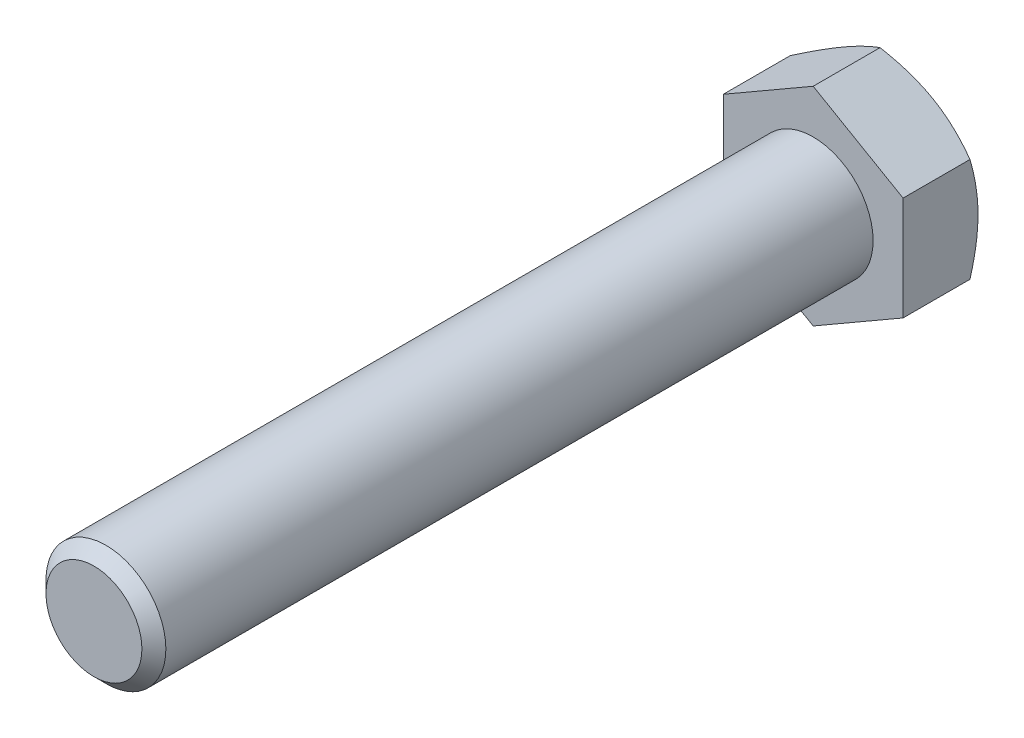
ISO-10303-21;
HEADER;
FILE_DESCRIPTION(('STEP AP214'),'2;1');
FILE_NAME('part.step','',(''),(''),'','','');
FILE_SCHEMA(('AUTOMOTIVE_DESIGN { 1 0 10303 214 1 1 1 1 }'));
ENDSEC;
DATA;
#1=APPLICATION_CONTEXT('core data for automotive mechanical design processes');
#2=APPLICATION_PROTOCOL_DEFINITION('international standard','automotive_design',2000,#1);
#3=PRODUCT_CONTEXT('',#1,'mechanical');
#4=PRODUCT('Part','Part','',(#3));
#5=PRODUCT_RELATED_PRODUCT_CATEGORY('part','',(#4));
#6=PRODUCT_DEFINITION_FORMATION('','',#4);
#7=PRODUCT_DEFINITION_CONTEXT('part definition',#1,'design');
#8=PRODUCT_DEFINITION('design','',#6,#7);
#9=PRODUCT_DEFINITION_SHAPE('','',#8);
#10=(LENGTH_UNIT() NAMED_UNIT(*) SI_UNIT(.MILLI.,.METRE.));
#11=(NAMED_UNIT(*) PLANE_ANGLE_UNIT() SI_UNIT($,.RADIAN.));
#12=(NAMED_UNIT(*) SI_UNIT($,.STERADIAN.) SOLID_ANGLE_UNIT());
#13=UNCERTAINTY_MEASURE_WITH_UNIT(LENGTH_MEASURE(1.E-05),#10,'distance_accuracy_value','');
#14=(GEOMETRIC_REPRESENTATION_CONTEXT(3) GLOBAL_UNCERTAINTY_ASSIGNED_CONTEXT((#13)) GLOBAL_UNIT_ASSIGNED_CONTEXT((#10,
#11,#12)) REPRESENTATION_CONTEXT('',''));
#15=CARTESIAN_POINT('',(0.,0.,0.));
#16=DIRECTION('',(0.,0.,1.));
#17=DIRECTION('',(1.,0.,0.));
#18=AXIS2_PLACEMENT_3D('',#15,#16,#17);
#19=CARTESIAN_POINT('',(0.,0.,120.));
#20=DIRECTION('',(0.,0.,0.999999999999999));
#21=DIRECTION('',(1.,0.,0.));
#22=AXIS2_PLACEMENT_3D('',#19,#20,#21);
#23=PLANE('',#22);
#24=CARTESIAN_POINT('',(0.,0.,120.));
#25=DIRECTION('',(0.,0.,0.999999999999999));
#26=DIRECTION('',(1.,0.,0.));
#27=AXIS2_PLACEMENT_3D('',#24,#25,#26);
#28=CIRCLE('',#27,8.00000000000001);
#29=CARTESIAN_POINT('',(8.00000000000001,0.,120.));
#30=VERTEX_POINT('',#29);
#31=EDGE_CURVE('E204',#30,#30,#28,.T.);
#32=ORIENTED_EDGE('',*,*,#31,.T.);
#33=EDGE_LOOP('',(#32));
#34=FACE_BOUND('',#33,.T.);
#35=ADVANCED_FACE('F30',(#34),#23,.T.);
#36=CARTESIAN_POINT('',(0.,0.,0.));
#37=DIRECTION('',(0.,0.,0.999999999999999));
#38=DIRECTION('',(1.,0.,0.));
#39=AXIS2_PLACEMENT_3D('',#36,#37,#38);
#40=CYLINDRICAL_SURFACE('',#39,10.);
#41=CARTESIAN_POINT('',(0.,-1.38777878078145E-13,118.));
#42=DIRECTION('',(0.,0.,0.999999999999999));
#43=DIRECTION('',(1.,0.,0.));
#44=AXIS2_PLACEMENT_3D('',#41,#42,#43);
#45=CIRCLE('',#44,10.);
#46=CARTESIAN_POINT('',(10.0000000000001,0.,118.));
#47=VERTEX_POINT('',#46);
#48=EDGE_CURVE('E206',#47,#47,#45,.F.);
#49=CARTESIAN_POINT('',(0.,0.,0.));
#50=DIRECTION('',(0.,0.,0.999999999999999));
#51=DIRECTION('',(1.,0.,0.));
#52=AXIS2_PLACEMENT_3D('',#49,#50,#51);
#53=CIRCLE('',#52,10.);
#54=CARTESIAN_POINT('',(10.,0.,0.));
#55=VERTEX_POINT('',#54);
#56=EDGE_CURVE('E207',#55,#55,#53,.F.);
#57=CARTESIAN_POINT('',(10.0000000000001,0.,118.));
#58=CARTESIAN_POINT('',(10.0000000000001,0.,116.770833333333));
#59=CARTESIAN_POINT('',(10.0000000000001,0.,115.541666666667));
#60=CARTESIAN_POINT('',(10.0000000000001,0.,113.083333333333));
#61=CARTESIAN_POINT('',(10.0000000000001,0.,111.854166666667));
#62=CARTESIAN_POINT('',(10.0000000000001,0.,109.395833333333));
#63=CARTESIAN_POINT('',(10.0000000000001,0.,108.166666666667));
#64=CARTESIAN_POINT('',(10.0000000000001,0.,105.708333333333));
#65=CARTESIAN_POINT('',(10.0000000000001,0.,104.479166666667));
#66=CARTESIAN_POINT('',(10.0000000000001,0.,102.020833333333));
#67=CARTESIAN_POINT('',(10.0000000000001,0.,100.791666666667));
#68=CARTESIAN_POINT('',(10.0000000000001,0.,98.3333333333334));
#69=CARTESIAN_POINT('',(10.0000000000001,0.,97.1041666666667));
#70=CARTESIAN_POINT('',(10.0000000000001,0.,94.6458333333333));
#71=CARTESIAN_POINT('',(10.0000000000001,0.,93.4166666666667));
#72=CARTESIAN_POINT('',(10.0000000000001,0.,90.9583333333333));
#73=CARTESIAN_POINT('',(10.0000000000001,0.,89.7291666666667));
#74=CARTESIAN_POINT('',(10.0000000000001,0.,87.2708333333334));
#75=CARTESIAN_POINT('',(10.0000000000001,0.,86.0416666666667));
#76=CARTESIAN_POINT('',(10.0000000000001,0.,83.5833333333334));
#77=CARTESIAN_POINT('',(10.0000000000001,0.,82.3541666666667));
#78=CARTESIAN_POINT('',(10.0000000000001,0.,79.8958333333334));
#79=CARTESIAN_POINT('',(10.0000000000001,0.,78.6666666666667));
#80=CARTESIAN_POINT('',(10.0000000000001,0.,76.2083333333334));
#81=CARTESIAN_POINT('',(10.0000000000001,0.,74.9791666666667));
#82=CARTESIAN_POINT('',(10.0000000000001,0.,72.5208333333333));
#83=CARTESIAN_POINT('',(10.0000000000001,0.,71.2916666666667));
#84=CARTESIAN_POINT('',(10.0000000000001,0.,68.8333333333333));
#85=CARTESIAN_POINT('',(10.0000000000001,0.,67.6041666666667));
#86=CARTESIAN_POINT('',(10.,0.,65.1458333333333));
#87=CARTESIAN_POINT('',(10.,0.,63.9166666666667));
#88=CARTESIAN_POINT('',(10.,0.,61.4583333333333));
#89=CARTESIAN_POINT('',(10.,0.,60.2291666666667));
#90=CARTESIAN_POINT('',(10.,0.,57.7708333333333));
#91=CARTESIAN_POINT('',(10.,0.,56.5416666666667));
#92=CARTESIAN_POINT('',(10.,0.,54.0833333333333));
#93=CARTESIAN_POINT('',(10.,0.,52.8541666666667));
#94=CARTESIAN_POINT('',(10.,0.,50.3958333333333));
#95=CARTESIAN_POINT('',(10.,0.,49.1666666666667));
#96=CARTESIAN_POINT('',(10.,0.,46.7083333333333));
#97=CARTESIAN_POINT('',(10.,0.,45.4791666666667));
#98=CARTESIAN_POINT('',(10.,0.,43.0208333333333));
#99=CARTESIAN_POINT('',(10.,0.,41.7916666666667));
#100=CARTESIAN_POINT('',(10.,0.,39.3333333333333));
#101=CARTESIAN_POINT('',(10.,0.,38.1041666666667));
#102=CARTESIAN_POINT('',(10.,0.,35.6458333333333));
#103=CARTESIAN_POINT('',(10.,0.,34.4166666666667));
#104=CARTESIAN_POINT('',(10.,0.,31.9583333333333));
#105=CARTESIAN_POINT('',(10.,0.,30.7291666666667));
#106=CARTESIAN_POINT('',(10.,0.,28.2708333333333));
#107=CARTESIAN_POINT('',(10.,0.,27.0416666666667));
#108=CARTESIAN_POINT('',(10.,0.,24.5833333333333));
#109=CARTESIAN_POINT('',(10.,0.,23.3541666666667));
#110=CARTESIAN_POINT('',(10.,0.,20.8958333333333));
#111=CARTESIAN_POINT('',(10.,0.,19.6666666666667));
#112=CARTESIAN_POINT('',(10.,0.,17.2083333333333));
#113=CARTESIAN_POINT('',(10.,0.,15.9791666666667));
#114=CARTESIAN_POINT('',(10.,0.,13.5208333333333));
#115=CARTESIAN_POINT('',(10.,0.,12.2916666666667));
#116=CARTESIAN_POINT('',(10.,0.,9.83333333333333));
#117=CARTESIAN_POINT('',(10.,0.,8.60416666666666));
#118=CARTESIAN_POINT('',(10.,0.,6.14583333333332));
#119=CARTESIAN_POINT('',(10.,0.,4.91666666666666));
#120=CARTESIAN_POINT('',(10.,0.,2.45833333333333));
#121=CARTESIAN_POINT('',(10.,0.,1.22916666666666));
#122=CARTESIAN_POINT('',(10.,0.,0.));
#123=B_SPLINE_CURVE_WITH_KNOTS('',3,(#57,#58,#59,#60,#61,#62,#63,#64,#65,#66,#67,#68,#69,#70,
#71,#72,#73,#74,#75,#76,#77,#78,#79,#80,#81,#82,#83,#84,#85,#86,#87,#88,#89,#90,#91,#92,#93,#94,
#95,#96,#97,#98,#99,#100,#101,#102,#103,#104,#105,#106,#107,#108,#109,#110,#111,#112,#113,#114,
#115,#116,#117,#118,#119,#120,#121,#122),.UNSPECIFIED.,.F.,.F.,(4,2,2,2,2,2,2,2,2,2,2,2,2,2,2,2,
2,2,2,2,2,2,2,2,2,2,2,2,2,2,2,2,4),(0.,3.68750000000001,7.37500000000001,11.0625,14.75,18.4375,
22.125,25.8125,29.5,33.1875,36.875,40.5625,44.25,47.9375,51.625,55.3125,59.,62.6875,66.375,
70.0625,73.75,77.4375,81.125,84.8125,88.5000000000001,92.1875,95.8750000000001,99.5625000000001,
103.25,106.9375,110.625,114.3125,118.),.UNSPECIFIED.);
#124=EDGE_CURVE('BSEAM195',#47,#55,#123,.T.);
#125=ORIENTED_EDGE('',*,*,#48,.T.);
#126=ORIENTED_EDGE('',*,*,#56,.F.);
#127=ORIENTED_EDGE('',*,*,#124,.T.);
#128=ORIENTED_EDGE('',*,*,#124,.F.);
#129=EDGE_LOOP('',(#125,#127,#126,#128));
#130=FACE_BOUND('',#129,.T.);
#131=ADVANCED_FACE('F195',(#130),#40,.T.);
#132=CARTESIAN_POINT('',(0.,0.,120.));
#133=DIRECTION('',(0.,0.,-0.999999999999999));
#134=DIRECTION('',(-1.,0.,0.));
#135=AXIS2_PLACEMENT_3D('',#132,#133,#134);
#136=CONICAL_SURFACE('',#135,8.00000000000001,0.785398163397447);
#137=ORIENTED_EDGE('',*,*,#48,.F.);
#138=EDGE_LOOP('',(#137));
#139=FACE_BOUND('',#138,.T.);
#140=ORIENTED_EDGE('',*,*,#31,.F.);
#141=EDGE_LOOP('',(#140));
#142=FACE_BOUND('',#141,.T.);
#143=ADVANCED_FACE('F200',(#139,#142),#136,.T.);
#144=CARTESIAN_POINT('',(-1.11022302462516E-13,17.3205080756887,-12.5));
#145=DIRECTION('',(0.499999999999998,0.86602540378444,0.));
#146=DIRECTION('',(-0.866025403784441,0.499999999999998,0.));
#147=AXIS2_PLACEMENT_3D('',#144,#145,#146);
#148=PLANE('',#147);
#149=CARTESIAN_POINT('',(-0.000200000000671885,17.3206235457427,-11.160187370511));
#150=CARTESIAN_POINT('',(0.329494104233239,17.1302745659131,-11.270078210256));
#151=CARTESIAN_POINT('',(0.660474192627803,16.9391831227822,-11.3749824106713));
#152=CARTESIAN_POINT('',(1.3250884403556,16.5554679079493,-11.5734314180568));
#153=CARTESIAN_POINT('',(1.65872343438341,16.3628436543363,-11.6669724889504));
#154=CARTESIAN_POINT('',(2.32929228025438,15.9756905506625,-11.8414378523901));
#155=CARTESIAN_POINT('',(2.6662320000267,15.7811583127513,-11.9223322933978));
#156=CARTESIAN_POINT('',(3.34245276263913,15.3907420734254,-12.069767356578));
#157=CARTESIAN_POINT('',(3.68173367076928,15.1948581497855,-12.1363087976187));
#158=CARTESIAN_POINT('',(4.35394314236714,14.8067578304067,-12.2522076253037));
#159=CARTESIAN_POINT('',(4.68682180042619,14.6145702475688,-12.3019486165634));
#160=CARTESIAN_POINT('',(5.35410443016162,14.2293144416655,-12.3853532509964));
#161=CARTESIAN_POINT('',(5.68850843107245,14.0362462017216,-12.41901658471));
#162=CARTESIAN_POINT('',(6.35787818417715,13.6497853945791,-12.469415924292));
#163=CARTESIAN_POINT('',(6.69284279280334,13.4563934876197,-12.486172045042));
#164=CARTESIAN_POINT('',(7.36308121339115,13.0694311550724,-12.502396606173));
#165=CARTESIAN_POINT('',(7.69835501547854,12.8758607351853,-12.5018655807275));
#166=CARTESIAN_POINT('',(8.32514688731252,12.513982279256,-12.4847233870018));
#167=CARTESIAN_POINT('',(8.61670962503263,12.3456484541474,-12.470203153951));
#168=CARTESIAN_POINT('',(9.19916443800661,12.0093680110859,-12.4283628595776));
#169=CARTESIAN_POINT('',(9.49005646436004,11.8414214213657,-12.4010418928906));
#170=CARTESIAN_POINT('',(10.0710118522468,11.5060066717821,-12.3340764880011));
#171=CARTESIAN_POINT('',(10.3610743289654,11.3385390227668,-12.2944218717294));
#172=CARTESIAN_POINT('',(10.9398394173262,11.0043888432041,-12.2034848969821));
#173=CARTESIAN_POINT('',(11.2285419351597,10.8377063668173,-12.1522017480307));
#174=CARTESIAN_POINT('',(12.1049144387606,10.3317324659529,-11.9796131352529));
#175=CARTESIAN_POINT('',(12.6900465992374,9.99390625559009,-11.8410988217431));
#176=CARTESIAN_POINT('',(13.8515859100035,9.32329122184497,-11.5267280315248));
#177=CARTESIAN_POINT('',(14.4280079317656,8.99049381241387,-11.3509453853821));
#178=CARTESIAN_POINT('',(15.0002000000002,8.66013856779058,-11.160187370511));
#179=B_SPLINE_CURVE_WITH_KNOTS('',3,(#149,#150,#151,#152,#153,#154,#155,#156,#157,#158,#159,
#160,#161,#162,#163,#164,#165,#166,#167,#168,#169,#170,#171,#172,#173,#174,#175,#176,#177,#178),
.UNSPECIFIED.,.F.,.F.,(4,2,2,2,2,2,2,2,2,2,2,2,2,2,4),(0.,1.18875411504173,2.37789802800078,
3.56980778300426,4.76164951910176,5.92407379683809,7.08652044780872,8.24758247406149,
9.40860862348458,10.4193068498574,11.430076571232,12.4416826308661,13.4533574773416,
15.5211962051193,17.5849760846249),.UNSPECIFIED.);
#180=CARTESIAN_POINT('',(-1.11022302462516E-13,17.3205080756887,-11.1602540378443));
#181=VERTEX_POINT('',#180);
#182=CARTESIAN_POINT('',(7.49999999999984,12.9903810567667,-12.5));
#183=VERTEX_POINT('',#182);
#184=EDGE_CURVE('E240',#181,#183,#179,.T.);
#185=ORIENTED_EDGE('',*,*,#184,.F.);
#186=DIRECTION('',(0.,0.,0.999999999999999));
#187=VECTOR('',#186,1.);
#188=CARTESIAN_POINT('',(-1.11022302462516E-13,17.3205080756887,-12.5));
#189=LINE('',#188,#187);
#190=CARTESIAN_POINT('',(-1.11022302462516E-13,17.3205080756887,0.));
#191=VERTEX_POINT('',#190);
#192=EDGE_CURVE('E214',#181,#191,#189,.T.);
#193=ORIENTED_EDGE('',*,*,#192,.T.);
#194=DIRECTION('',(-0.866025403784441,0.499999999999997,0.));
#195=VECTOR('',#194,1.);
#196=CARTESIAN_POINT('',(-1.11022302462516E-13,17.3205080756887,0.));
#197=LINE('',#196,#195);
#198=CARTESIAN_POINT('',(14.9999999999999,8.66025403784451,0.));
#199=VERTEX_POINT('',#198);
#200=EDGE_CURVE('E238',#199,#191,#197,.T.);
#201=ORIENTED_EDGE('',*,*,#200,.F.);
#202=DIRECTION('',(0.,0.,0.999999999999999));
#203=VECTOR('',#202,1.);
#204=CARTESIAN_POINT('',(15.0000000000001,8.66025403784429,-12.5));
#205=LINE('',#204,#203);
#206=CARTESIAN_POINT('',(15.0000000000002,8.66025403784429,-11.1602540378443));
#207=VERTEX_POINT('',#206);
#208=EDGE_CURVE('E211',#207,#199,#205,.T.);
#209=ORIENTED_EDGE('',*,*,#208,.F.);
#210=EDGE_CURVE('E170',#183,#207,#179,.T.);
#211=ORIENTED_EDGE('',*,*,#210,.F.);
#212=EDGE_LOOP('',(#185,#193,#201,#209,#211));
#213=FACE_BOUND('',#212,.T.);
#214=ADVANCED_FACE('F180',(#213),#148,.T.);
#215=CARTESIAN_POINT('',(14.9999999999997,-8.66025403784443,-12.4999999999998));
#216=DIRECTION('',(1.,0.,0.));
#217=DIRECTION('',(0.,0.,-0.999999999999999));
#218=AXIS2_PLACEMENT_3D('',#215,#216,#217);
#219=PLANE('',#218);
#220=CARTESIAN_POINT('',(15.0000000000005,-23.6563424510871,-4.9880295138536));
#221=CARTESIAN_POINT('',(15.,-23.327036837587,-5.14859323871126));
#222=CARTESIAN_POINT('',(14.9999999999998,-22.9973552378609,-5.30838548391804));
#223=CARTESIAN_POINT('',(14.9999999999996,-22.3371617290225,-5.62625300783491));
#224=CARTESIAN_POINT('',(14.9999999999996,-22.0066498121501,-5.78432827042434));
#225=CARTESIAN_POINT('',(14.9999999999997,-21.0136682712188,-6.25575678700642));
#226=CARTESIAN_POINT('',(14.9999999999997,-20.3498444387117,-6.56626799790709));
#227=CARTESIAN_POINT('',(14.9999999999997,-19.0144565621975,-7.17949488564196));
#228=CARTESIAN_POINT('',(14.9999999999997,-18.3428702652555,-7.48216221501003));
#229=CARTESIAN_POINT('',(14.9999999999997,-16.9944919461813,-8.07562821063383));
#230=CARTESIAN_POINT('',(14.9999999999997,-16.317700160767,-8.36642741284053));
#231=CARTESIAN_POINT('',(14.9999999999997,-14.9346939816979,-8.94267079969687));
#232=CARTESIAN_POINT('',(14.9999999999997,-14.2282621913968,-9.22759584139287));
#233=CARTESIAN_POINT('',(14.9999999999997,-12.8072761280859,-9.77682099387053));
#234=CARTESIAN_POINT('',(14.9999999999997,-12.0927209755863,-10.041118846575));
#235=CARTESIAN_POINT('',(14.9999999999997,-10.655587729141,-10.5424349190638));
#236=CARTESIAN_POINT('',(14.9999999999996,-9.93302789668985,-10.7795050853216));
#237=CARTESIAN_POINT('',(14.9999999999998,-8.47748492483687,-11.2190363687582));
#238=CARTESIAN_POINT('',(15.,-7.74450501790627,-11.4215079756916));
#239=CARTESIAN_POINT('',(14.9999999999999,-6.63906626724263,-11.6915912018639));
#240=CARTESIAN_POINT('',(14.9999999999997,-6.27064605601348,-11.7758229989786));
#241=CARTESIAN_POINT('',(14.9999999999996,-5.53121828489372,-11.9321086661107));
#242=CARTESIAN_POINT('',(14.9999999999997,-5.16021077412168,-12.0041627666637));
#243=CARTESIAN_POINT('',(14.9999999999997,-4.41583632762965,-12.1348466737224));
#244=CARTESIAN_POINT('',(14.9999999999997,-4.04246944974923,-12.193476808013));
#245=CARTESIAN_POINT('',(14.9999999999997,-3.29373978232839,-12.2961594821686));
#246=CARTESIAN_POINT('',(14.9999999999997,-2.91837708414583,-12.3402126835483));
#247=CARTESIAN_POINT('',(14.9999999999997,-2.17125057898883,-12.4122914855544));
#248=CARTESIAN_POINT('',(14.9999999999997,-1.79950710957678,-12.4405265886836));
#249=CARTESIAN_POINT('',(14.9999999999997,-1.05515863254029,-12.4812352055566));
#250=CARTESIAN_POINT('',(14.9999999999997,-0.682553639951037,-12.4937089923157));
#251=CARTESIAN_POINT('',(14.9999999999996,0.0628536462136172,-12.5025960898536));
#252=CARTESIAN_POINT('',(14.9999999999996,0.435655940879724,-12.4990093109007));
#253=CARTESIAN_POINT('',(14.9999999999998,1.18076829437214,-12.4758669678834));
#254=CARTESIAN_POINT('',(15.0000000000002,1.55307833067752,-12.456310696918));
#255=CARTESIAN_POINT('',(15.0000000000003,2.43604587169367,-12.3914173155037));
#256=CARTESIAN_POINT('',(14.9999999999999,2.94620665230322,-12.3391608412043));
#257=CARTESIAN_POINT('',(14.9999999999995,3.96297341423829,-12.2074265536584));
#258=CARTESIAN_POINT('',(14.9999999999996,4.4695789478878,-12.1279453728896));
#259=CARTESIAN_POINT('',(14.9999999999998,5.98333889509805,-11.8528606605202));
#260=CARTESIAN_POINT('',(14.9999999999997,6.98394325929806,-11.6206572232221));
#261=CARTESIAN_POINT('',(14.9999999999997,8.48096930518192,-11.2149672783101));
#262=CARTESIAN_POINT('',(14.9999999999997,8.98506717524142,-11.0681521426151));
#263=CARTESIAN_POINT('',(14.9999999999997,9.98837333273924,-10.758523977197));
#264=CARTESIAN_POINT('',(14.9999999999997,10.4875815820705,-10.595710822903));
#265=CARTESIAN_POINT('',(14.9999999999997,11.4812605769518,-10.2567587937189));
#266=CARTESIAN_POINT('',(14.9999999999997,11.9757325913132,-10.0806236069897));
#267=CARTESIAN_POINT('',(14.9999999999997,12.7143247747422,-9.80804005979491));
#268=CARTESIAN_POINT('',(14.9999999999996,12.9600014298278,-9.71578264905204));
#269=CARTESIAN_POINT('',(14.9999999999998,13.4503781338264,-9.52870505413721));
#270=CARTESIAN_POINT('',(15.,13.6950781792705,-9.43388486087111));
#271=CARTESIAN_POINT('',(15.0000000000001,14.3593902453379,-9.17279784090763));
#272=CARTESIAN_POINT('',(14.9999999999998,14.7781022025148,-9.00423842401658));
#273=CARTESIAN_POINT('',(14.9999999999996,15.6130793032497,-8.66115582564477));
#274=CARTESIAN_POINT('',(14.9999999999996,16.0293443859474,-8.48663249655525));
#275=CARTESIAN_POINT('',(14.9999999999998,17.2749256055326,-7.95534410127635));
#276=CARTESIAN_POINT('',(14.9999999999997,18.1009632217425,-7.59088627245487));
#277=CARTESIAN_POINT('',(14.9999999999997,19.7463472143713,-6.84641952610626));
#278=CARTESIAN_POINT('',(14.9999999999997,20.5656908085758,-6.46640450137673));
#279=CARTESIAN_POINT('',(14.9999999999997,22.1987342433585,-5.69454980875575));
#280=CARTESIAN_POINT('',(14.9999999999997,23.0124343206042,-5.30271064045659));
#281=CARTESIAN_POINT('',(14.9999999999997,24.6366504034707,-4.50915614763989));
#282=CARTESIAN_POINT('',(14.9999999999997,25.4471589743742,-4.10742564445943));
#283=CARTESIAN_POINT('',(14.9999999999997,27.0645048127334,-3.29663533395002));
#284=CARTESIAN_POINT('',(14.9999999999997,27.8713420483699,-2.88757546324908));
#285=CARTESIAN_POINT('',(14.9999999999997,29.4818238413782,-2.06366878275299));
#286=CARTESIAN_POINT('',(14.9999999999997,30.2854690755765,-1.64882329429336));
#287=CARTESIAN_POINT('',(14.9999999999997,31.8902654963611,-0.814347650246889));
#288=CARTESIAN_POINT('',(14.9999999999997,32.6914166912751,-0.394717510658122));
#289=CARTESIAN_POINT('',(14.9999999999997,34.9203498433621,0.779727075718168));
#290=CARTESIAN_POINT('',(14.9999999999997,36.3458714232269,1.53883048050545));
#291=CARTESIAN_POINT('',(14.9999999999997,39.1921522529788,3.06610948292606));
#292=CARTESIAN_POINT('',(14.9999999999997,40.6129111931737,3.83428565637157));
#293=CARTESIAN_POINT('',(14.9999999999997,43.4459001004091,5.37475686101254));
#294=CARTESIAN_POINT('',(14.9999999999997,44.8581426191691,6.14702882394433));
#295=CARTESIAN_POINT('',(14.9999999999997,46.9743278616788,7.30926449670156));
#296=CARTESIAN_POINT('',(14.9999999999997,47.6793316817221,7.69729873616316));
#297=CARTESIAN_POINT('',(14.9999999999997,49.08870787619,8.47451029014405));
#298=CARTESIAN_POINT('',(14.9999999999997,49.7930802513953,8.8636876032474));
#299=CARTESIAN_POINT('',(14.9999999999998,50.4971756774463,9.25336545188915));
#300=B_SPLINE_CURVE_WITH_KNOTS('',3,(#220,#221,#222,#223,#224,#225,#226,#227,#228,#229,#230,
#231,#232,#233,#234,#235,#236,#237,#238,#239,#240,#241,#242,#243,#244,#245,#246,#247,#248,#249,
#250,#251,#252,#253,#254,#255,#256,#257,#258,#259,#260,#261,#262,#263,#264,#265,#266,#267,#268,
#269,#270,#271,#272,#273,#274,#275,#276,#277,#278,#279,#280,#281,#282,#283,#284,#285,#286,#287,
#288,#289,#290,#291,#292,#293,#294,#295,#296,#297,#298,#299),.UNSPECIFIED.,.F.,.F.,(4,2,2,2,2,2,
2,2,2,2,2,2,2,2,2,2,2,2,2,2,2,2,2,2,2,2,2,2,2,2,2,2,2,2,2,2,2,2,2,4),(0.,1.09909142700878,
2.19819316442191,4.39670244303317,6.60652703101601,8.81625171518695,11.1011868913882,
13.3863718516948,15.667121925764,17.94717927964,19.0807901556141,20.2143795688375,
21.3479412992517,22.4814515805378,23.5995709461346,24.7176709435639,25.8357771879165,
26.9539329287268,28.4915630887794,30.0293835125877,33.1065029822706,34.6814865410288,
36.2564823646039,37.831043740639,38.6183151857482,39.4055894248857,40.7596309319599,
42.1137059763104,44.8220642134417,47.5314960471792,50.2408135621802,52.9545856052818,
55.6683811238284,58.3815666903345,61.0947431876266,65.9398079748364,70.7851819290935,
75.6139863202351,78.0281952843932,80.4424012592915),.UNSPECIFIED.);
#301=CARTESIAN_POINT('',(15.0000000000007,1.11022302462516E-13,-12.5));
#302=VERTEX_POINT('',#301);
#303=EDGE_CURVE('E168',#207,#302,#300,.F.);
#304=ORIENTED_EDGE('',*,*,#303,.F.);
#305=ORIENTED_EDGE('',*,*,#208,.T.);
#306=DIRECTION('',(0.,1.,0.));
#307=VECTOR('',#306,1.);
#308=CARTESIAN_POINT('',(14.9999999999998,-8.66025403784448,0.));
#309=LINE('',#308,#307);
#310=CARTESIAN_POINT('',(14.9999999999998,-8.66025403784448,0.));
#311=VERTEX_POINT('',#310);
#312=EDGE_CURVE('E216',#311,#199,#309,.T.);
#313=ORIENTED_EDGE('',*,*,#312,.F.);
#314=DIRECTION('',(0.,0.,0.999999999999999));
#315=VECTOR('',#314,1.);
#316=CARTESIAN_POINT('',(14.9999999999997,-8.66025403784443,-12.4999999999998));
#317=LINE('',#316,#315);
#318=CARTESIAN_POINT('',(14.9999999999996,-8.66025403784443,-11.1602540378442));
#319=VERTEX_POINT('',#318);
#320=EDGE_CURVE('E222',#319,#311,#317,.T.);
#321=ORIENTED_EDGE('',*,*,#320,.F.);
#322=EDGE_CURVE('E163',#302,#319,#300,.F.);
#323=ORIENTED_EDGE('',*,*,#322,.F.);
#324=EDGE_LOOP('',(#304,#305,#313,#321,#323));
#325=FACE_BOUND('',#324,.T.);
#326=ADVANCED_FACE('F176',(#325),#219,.T.);
#327=CARTESIAN_POINT('',(2.22044604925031E-13,-17.3205080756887,-12.5));
#328=DIRECTION('',(0.499999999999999,-0.866025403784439,0.));
#329=DIRECTION('',(0.866025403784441,0.499999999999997,0.));
#330=AXIS2_PLACEMENT_3D('',#327,#328,#329);
#331=PLANE('',#330);
#332=CARTESIAN_POINT('',(15.0002000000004,-8.66013856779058,-11.1601873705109));
#333=CARTESIAN_POINT('',(14.6705058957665,-8.85048754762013,-11.270078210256));
#334=CARTESIAN_POINT('',(14.339525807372,-9.04157899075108,-11.3749824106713));
#335=CARTESIAN_POINT('',(13.6749115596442,-9.42529420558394,-11.5734314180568));
#336=CARTESIAN_POINT('',(13.3412765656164,-9.61791845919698,-11.6669724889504));
#337=CARTESIAN_POINT('',(12.6707077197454,-10.0050715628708,-11.8414378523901));
#338=CARTESIAN_POINT('',(12.3337679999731,-10.199603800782,-11.9223322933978));
#339=CARTESIAN_POINT('',(11.6575472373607,-10.5900200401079,-12.0697673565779));
#340=CARTESIAN_POINT('',(11.3182663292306,-10.7859039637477,-12.1363087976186));
#341=CARTESIAN_POINT('',(10.6460568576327,-11.1740042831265,-12.2522076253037));
#342=CARTESIAN_POINT('',(10.3131781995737,-11.3661918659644,-12.3019486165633));
#343=CARTESIAN_POINT('',(9.64589556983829,-11.7514476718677,-12.3853532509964));
#344=CARTESIAN_POINT('',(9.31149156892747,-11.9445159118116,-12.4190165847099));
#345=CARTESIAN_POINT('',(8.64212181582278,-12.330976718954,-12.4694159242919));
#346=CARTESIAN_POINT('',(8.30715720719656,-12.5243686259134,-12.486172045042));
#347=CARTESIAN_POINT('',(7.63691878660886,-12.9113309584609,-12.502396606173));
#348=CARTESIAN_POINT('',(7.30164498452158,-13.1049013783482,-12.5018655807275));
#349=CARTESIAN_POINT('',(6.67485311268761,-13.4667798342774,-12.4847233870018));
#350=CARTESIAN_POINT('',(6.38329037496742,-13.6351136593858,-12.4702031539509));
#351=CARTESIAN_POINT('',(5.80083556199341,-13.9713941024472,-12.4283628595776));
#352=CARTESIAN_POINT('',(5.50994353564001,-14.1393406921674,-12.4010418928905));
#353=CARTESIAN_POINT('',(4.9289881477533,-14.474755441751,-12.3340764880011));
#354=CARTESIAN_POINT('',(4.63892567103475,-14.6422230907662,-12.2944218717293));
#355=CARTESIAN_POINT('',(4.06016058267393,-14.9763732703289,-12.2034848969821));
#356=CARTESIAN_POINT('',(3.77145806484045,-15.1430557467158,-12.1522017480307));
#357=CARTESIAN_POINT('',(2.89508556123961,-15.6490296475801,-11.9796131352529));
#358=CARTESIAN_POINT('',(2.30995340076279,-15.9868558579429,-11.8410988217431));
#359=CARTESIAN_POINT('',(1.14841408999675,-16.657470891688,-11.5267280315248));
#360=CARTESIAN_POINT('',(0.571992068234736,-16.9902683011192,-11.3509453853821));
#361=CARTESIAN_POINT('',(-0.000199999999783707,-17.3206235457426,-11.160187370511));
#362=B_SPLINE_CURVE_WITH_KNOTS('',3,(#332,#333,#334,#335,#336,#337,#338,#339,#340,#341,#342,
#343,#344,#345,#346,#347,#348,#349,#350,#351,#352,#353,#354,#355,#356,#357,#358,#359,#360,#361),
.UNSPECIFIED.,.F.,.F.,(4,2,2,2,2,2,2,2,2,2,2,2,2,2,4),(0.,1.1887541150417,2.37789802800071,
3.56980778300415,4.76164951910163,5.92407379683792,7.08652044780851,8.24758247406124,
9.40860862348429,10.4193068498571,11.4300765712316,12.4416826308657,13.4533574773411,
15.5211962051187,17.5849760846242),.UNSPECIFIED.);
#363=CARTESIAN_POINT('',(7.50000000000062,-12.9903810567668,-12.5));
#364=VERTEX_POINT('',#363);
#365=EDGE_CURVE('E169',#319,#364,#362,.T.);
#366=ORIENTED_EDGE('',*,*,#365,.F.);
#367=ORIENTED_EDGE('',*,*,#320,.T.);
#368=DIRECTION('',(0.866025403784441,0.499999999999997,0.));
#369=VECTOR('',#368,1.);
#370=CARTESIAN_POINT('',(2.22044604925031E-13,-17.3205080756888,0.));
#371=LINE('',#370,#369);
#372=CARTESIAN_POINT('',(2.22044604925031E-13,-17.3205080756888,0.));
#373=VERTEX_POINT('',#372);
#374=EDGE_CURVE('E227',#373,#311,#371,.T.);
#375=ORIENTED_EDGE('',*,*,#374,.F.);
#376=DIRECTION('',(0.,0.,0.999999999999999));
#377=VECTOR('',#376,1.);
#378=CARTESIAN_POINT('',(2.22044604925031E-13,-17.3205080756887,-12.5));
#379=LINE('',#378,#377);
#380=CARTESIAN_POINT('',(1.11022302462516E-13,-17.3205080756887,-11.1602540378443));
#381=VERTEX_POINT('',#380);
#382=EDGE_CURVE('E220',#381,#373,#379,.T.);
#383=ORIENTED_EDGE('',*,*,#382,.F.);
#384=EDGE_CURVE('E157',#364,#381,#362,.T.);
#385=ORIENTED_EDGE('',*,*,#384,.F.);
#386=EDGE_LOOP('',(#366,#367,#375,#383,#385));
#387=FACE_BOUND('',#386,.T.);
#388=ADVANCED_FACE('F179',(#387),#331,.T.);
#389=CARTESIAN_POINT('',(2.22044604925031E-13,-17.3205080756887,-12.5));
#390=DIRECTION('',(-0.500000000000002,-0.866025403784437,0.));
#391=DIRECTION('',(0.866025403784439,-0.500000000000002,0.));
#392=AXIS2_PLACEMENT_3D('',#389,#390,#391);
#393=PLANE('',#392);
#394=CARTESIAN_POINT('',(0.000200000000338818,-17.3206235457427,-11.160187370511));
#395=CARTESIAN_POINT('',(-0.329494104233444,-17.130274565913,-11.270078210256));
#396=CARTESIAN_POINT('',(-0.660474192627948,-16.939183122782,-11.3749824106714));
#397=CARTESIAN_POINT('',(-1.32508844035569,-16.5554679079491,-11.5734314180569));
#398=CARTESIAN_POINT('',(-1.6587234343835,-16.3628436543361,-11.6669724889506));
#399=CARTESIAN_POINT('',(-2.32929228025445,-15.9756905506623,-11.8414378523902));
#400=CARTESIAN_POINT('',(-2.66623200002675,-15.7811583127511,-11.9223322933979));
#401=CARTESIAN_POINT('',(-3.34245276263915,-15.3907420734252,-12.069767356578));
#402=CARTESIAN_POINT('',(-3.6817336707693,-15.1948581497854,-12.1363087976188));
#403=CARTESIAN_POINT('',(-4.35394314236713,-14.8067578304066,-12.2522076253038));
#404=CARTESIAN_POINT('',(-4.68682180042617,-14.6145702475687,-12.3019486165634));
#405=CARTESIAN_POINT('',(-5.35410443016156,-14.2293144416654,-12.3853532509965));
#406=CARTESIAN_POINT('',(-5.68850843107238,-14.0362462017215,-12.41901658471));
#407=CARTESIAN_POINT('',(-6.35787818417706,-13.649785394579,-12.4694159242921));
#408=CARTESIAN_POINT('',(-6.69284279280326,-13.4563934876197,-12.4861720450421));
#409=CARTESIAN_POINT('',(-7.363081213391,-13.0694311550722,-12.5023966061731));
#410=CARTESIAN_POINT('',(-7.69835501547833,-12.875860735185,-12.5018655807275));
#411=CARTESIAN_POINT('',(-8.32514688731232,-12.5139822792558,-12.4847233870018));
#412=CARTESIAN_POINT('',(-8.61670962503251,-12.3456484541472,-12.4702031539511));
#413=CARTESIAN_POINT('',(-9.19916443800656,-12.0093680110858,-12.4283628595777));
#414=CARTESIAN_POINT('',(-9.49005646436,-11.8414214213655,-12.4010418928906));
#415=CARTESIAN_POINT('',(-10.0710118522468,-11.506006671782,-12.3340764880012));
#416=CARTESIAN_POINT('',(-10.3610743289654,-11.3385390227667,-12.2944218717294));
#417=CARTESIAN_POINT('',(-10.9398394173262,-11.0043888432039,-12.2034848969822));
#418=CARTESIAN_POINT('',(-11.2285419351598,-10.837706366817,-12.1522017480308));
#419=CARTESIAN_POINT('',(-12.1049144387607,-10.3317324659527,-11.9796131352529));
#420=CARTESIAN_POINT('',(-12.6900465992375,-9.99390625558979,-11.8410988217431));
#421=CARTESIAN_POINT('',(-13.8515859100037,-9.32329122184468,-11.5267280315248));
#422=CARTESIAN_POINT('',(-14.4280079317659,-8.99049381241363,-11.3509453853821));
#423=CARTESIAN_POINT('',(-15.0002000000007,-8.66013856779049,-11.160187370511));
#424=B_SPLINE_CURVE_WITH_KNOTS('',3,(#394,#395,#396,#397,#398,#399,#400,#401,#402,#403,#404,
#405,#406,#407,#408,#409,#410,#411,#412,#413,#414,#415,#416,#417,#418,#419,#420,#421,#422,#423),
.UNSPECIFIED.,.F.,.F.,(4,2,2,2,2,2,2,2,2,2,2,2,2,2,4),(0.,1.1887541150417,2.37789802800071,
3.56980778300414,4.7616495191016,5.9240737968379,7.08652044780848,8.24758247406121,
9.40860862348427,10.4193068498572,11.4300765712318,12.441682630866,13.4533574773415,
15.5211962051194,17.5849760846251),.UNSPECIFIED.);
#425=CARTESIAN_POINT('',(-7.50000000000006,-12.9903810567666,-12.4999999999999));
#426=VERTEX_POINT('',#425);
#427=EDGE_CURVE('E259',#381,#426,#424,.T.);
#428=ORIENTED_EDGE('',*,*,#427,.F.);
#429=ORIENTED_EDGE('',*,*,#382,.T.);
#430=DIRECTION('',(0.866025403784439,-0.500000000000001,0.));
#431=VECTOR('',#430,1.);
#432=CARTESIAN_POINT('',(2.22044604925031E-13,-17.3205080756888,0.));
#433=LINE('',#432,#431);
#434=CARTESIAN_POINT('',(-15.0000000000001,-8.66025403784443,0.));
#435=VERTEX_POINT('',#434);
#436=EDGE_CURVE('E230',#435,#373,#433,.T.);
#437=ORIENTED_EDGE('',*,*,#436,.F.);
#438=DIRECTION('',(0.,0.,0.999999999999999));
#439=VECTOR('',#438,1.);
#440=CARTESIAN_POINT('',(-15.,-8.66025403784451,-12.4999999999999));
#441=LINE('',#440,#439);
#442=CARTESIAN_POINT('',(-15.0000000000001,-8.66025403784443,-11.1602540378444));
#443=VERTEX_POINT('',#442);
#444=EDGE_CURVE('E218',#443,#435,#441,.T.);
#445=ORIENTED_EDGE('',*,*,#444,.F.);
#446=EDGE_CURVE('E106',#426,#443,#424,.T.);
#447=ORIENTED_EDGE('',*,*,#446,.F.);
#448=EDGE_LOOP('',(#428,#429,#437,#445,#447));
#449=FACE_BOUND('',#448,.T.);
#450=ADVANCED_FACE('F184',(#449),#393,.T.);
#451=CARTESIAN_POINT('',(-15.,-8.66025403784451,-12.4999999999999));
#452=DIRECTION('',(-1.,0.,0.));
#453=DIRECTION('',(0.,0.,0.999999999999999));
#454=AXIS2_PLACEMENT_3D('',#451,#452,#453);
#455=PLANE('',#454);
#456=CARTESIAN_POINT('',(-15.,-23.6563424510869,-4.98802951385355));
#457=CARTESIAN_POINT('',(-15.,-23.3270368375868,-5.14859323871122));
#458=CARTESIAN_POINT('',(-15.,-22.9973552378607,-5.308385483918));
#459=CARTESIAN_POINT('',(-15.,-22.3371617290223,-5.62625300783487));
#460=CARTESIAN_POINT('',(-15.,-22.0066498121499,-5.7843282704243));
#461=CARTESIAN_POINT('',(-15.,-21.0136682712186,-6.25575678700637));
#462=CARTESIAN_POINT('',(-15.,-20.3498444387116,-6.56626799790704));
#463=CARTESIAN_POINT('',(-15.,-19.0144565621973,-7.1794948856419));
#464=CARTESIAN_POINT('',(-15.,-18.3428702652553,-7.48216221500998));
#465=CARTESIAN_POINT('',(-15.,-16.9944919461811,-8.07562821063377));
#466=CARTESIAN_POINT('',(-15.,-16.3177001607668,-8.36642741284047));
#467=CARTESIAN_POINT('',(-15.,-14.9346939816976,-8.94267079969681));
#468=CARTESIAN_POINT('',(-15.,-14.2282621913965,-9.22759584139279));
#469=CARTESIAN_POINT('',(-15.,-12.8072761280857,-9.77682099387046));
#470=CARTESIAN_POINT('',(-15.,-12.0927209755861,-10.0411188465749));
#471=CARTESIAN_POINT('',(-15.,-10.6555877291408,-10.5424349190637));
#472=CARTESIAN_POINT('',(-15.,-9.93302789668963,-10.7795050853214));
#473=CARTESIAN_POINT('',(-15.,-8.4774849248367,-11.2190363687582));
#474=CARTESIAN_POINT('',(-15.,-7.74450501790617,-11.4215079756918));
#475=CARTESIAN_POINT('',(-15.,-6.63906626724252,-11.6915912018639));
#476=CARTESIAN_POINT('',(-15.,-6.27064605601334,-11.7758229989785));
#477=CARTESIAN_POINT('',(-15.,-5.53121828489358,-11.9321086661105));
#478=CARTESIAN_POINT('',(-15.,-5.16021077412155,-12.0041627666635));
#479=CARTESIAN_POINT('',(-15.,-4.41583632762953,-12.1348466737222));
#480=CARTESIAN_POINT('',(-15.,-4.04246944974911,-12.1934768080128));
#481=CARTESIAN_POINT('',(-15.,-3.29373978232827,-12.2961594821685));
#482=CARTESIAN_POINT('',(-15.,-2.91837708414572,-12.3402126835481));
#483=CARTESIAN_POINT('',(-15.,-2.17125057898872,-12.4122914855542));
#484=CARTESIAN_POINT('',(-15.,-1.79950710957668,-12.4405265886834));
#485=CARTESIAN_POINT('',(-15.,-1.05515863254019,-12.4812352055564));
#486=CARTESIAN_POINT('',(-15.,-0.682553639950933,-12.4937089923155));
#487=CARTESIAN_POINT('',(-15.,0.0628536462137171,-12.5025960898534));
#488=CARTESIAN_POINT('',(-15.,0.43565594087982,-12.4990093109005));
#489=CARTESIAN_POINT('',(-15.,1.18076829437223,-12.4758669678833));
#490=CARTESIAN_POINT('',(-15.0000000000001,1.55307833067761,-12.4563106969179));
#491=CARTESIAN_POINT('',(-15.0000000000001,2.43604587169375,-12.3914173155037));
#492=CARTESIAN_POINT('',(-15.,2.94620665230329,-12.3391608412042));
#493=CARTESIAN_POINT('',(-15.,3.96297341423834,-12.2074265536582));
#494=CARTESIAN_POINT('',(-15.,4.46957894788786,-12.1279453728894));
#495=CARTESIAN_POINT('',(-15.,5.98333889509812,-11.85286066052));
#496=CARTESIAN_POINT('',(-15.,6.98394325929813,-11.6206572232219));
#497=CARTESIAN_POINT('',(-15.,8.480969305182,-11.2149672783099));
#498=CARTESIAN_POINT('',(-15.,8.9850671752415,-11.0681521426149));
#499=CARTESIAN_POINT('',(-15.,9.98837333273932,-10.7585239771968));
#500=CARTESIAN_POINT('',(-15.,10.4875815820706,-10.5957108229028));
#501=CARTESIAN_POINT('',(-15.,11.4812605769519,-10.2567587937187));
#502=CARTESIAN_POINT('',(-15.,11.9757325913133,-10.0806236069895));
#503=CARTESIAN_POINT('',(-15.,12.7143247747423,-9.80804005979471));
#504=CARTESIAN_POINT('',(-15.,12.9600014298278,-9.71578264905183));
#505=CARTESIAN_POINT('',(-15.,13.4503781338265,-9.52870505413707));
#506=CARTESIAN_POINT('',(-15.,13.6950781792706,-9.43388486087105));
#507=CARTESIAN_POINT('',(-15.,14.3593902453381,-9.17279784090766));
#508=CARTESIAN_POINT('',(-15.,14.7781022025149,-9.00423842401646));
#509=CARTESIAN_POINT('',(-15.,15.6130793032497,-8.66115582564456));
#510=CARTESIAN_POINT('',(-15.,16.0293443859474,-8.48663249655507));
#511=CARTESIAN_POINT('',(-15.,17.2749256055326,-7.95534410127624));
#512=CARTESIAN_POINT('',(-15.,18.1009632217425,-7.59088627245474));
#513=CARTESIAN_POINT('',(-15.,19.7463472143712,-6.84641952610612));
#514=CARTESIAN_POINT('',(-15.,20.5656908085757,-6.46640450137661));
#515=CARTESIAN_POINT('',(-15.,22.1987342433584,-5.69454980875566));
#516=CARTESIAN_POINT('',(-15.,23.0124343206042,-5.3027106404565));
#517=CARTESIAN_POINT('',(-15.,24.6366504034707,-4.50915614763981));
#518=CARTESIAN_POINT('',(-15.,25.4471589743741,-4.10742564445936));
#519=CARTESIAN_POINT('',(-15.,27.0645048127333,-3.29663533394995));
#520=CARTESIAN_POINT('',(-15.,27.8713420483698,-2.88757546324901));
#521=CARTESIAN_POINT('',(-15.,29.4818238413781,-2.06366878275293));
#522=CARTESIAN_POINT('',(-15.,30.2854690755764,-1.64882329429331));
#523=CARTESIAN_POINT('',(-15.,31.890265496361,-0.814347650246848));
#524=CARTESIAN_POINT('',(-15.,32.691416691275,-0.394717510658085));
#525=CARTESIAN_POINT('',(-15.,34.9203498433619,0.7797270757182));
#526=CARTESIAN_POINT('',(-15.,36.3458714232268,1.53883048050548));
#527=CARTESIAN_POINT('',(-15.,39.1921522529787,3.0661094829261));
#528=CARTESIAN_POINT('',(-15.,40.6129111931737,3.83428565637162));
#529=CARTESIAN_POINT('',(-15.,43.445900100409,5.3747568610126));
#530=CARTESIAN_POINT('',(-15.,44.858142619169,6.14702882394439));
#531=CARTESIAN_POINT('',(-15.,46.9743278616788,7.30926449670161));
#532=CARTESIAN_POINT('',(-15.,47.6793316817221,7.69729873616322));
#533=CARTESIAN_POINT('',(-15.,49.0887078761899,8.4745102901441));
#534=CARTESIAN_POINT('',(-15.0000000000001,49.7930802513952,8.86368760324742));
#535=CARTESIAN_POINT('',(-15.0000000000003,50.4971756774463,9.25336545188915));
#536=B_SPLINE_CURVE_WITH_KNOTS('',3,(#456,#457,#458,#459,#460,#461,#462,#463,#464,#465,#466,
#467,#468,#469,#470,#471,#472,#473,#474,#475,#476,#477,#478,#479,#480,#481,#482,#483,#484,#485,
#486,#487,#488,#489,#490,#491,#492,#493,#494,#495,#496,#497,#498,#499,#500,#501,#502,#503,#504,
#505,#506,#507,#508,#509,#510,#511,#512,#513,#514,#515,#516,#517,#518,#519,#520,#521,#522,#523,
#524,#525,#526,#527,#528,#529,#530,#531,#532,#533,#534,#535),.UNSPECIFIED.,.F.,.F.,(4,2,2,2,2,2,
2,2,2,2,2,2,2,2,2,2,2,2,2,2,2,2,2,2,2,2,2,2,2,2,2,2,2,2,2,2,2,2,2,4),(0.,1.09909142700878,
2.19819316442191,4.39670244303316,6.60652703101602,8.81625171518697,11.1011868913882,
13.3863718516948,15.667121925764,17.9471792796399,19.080790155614,20.2143795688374,
21.3479412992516,22.4814515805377,23.5995709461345,24.7176709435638,25.8357771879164,
26.9539329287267,28.4915630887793,30.0293835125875,33.1065029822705,34.6814865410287,
36.2564823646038,37.8310437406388,38.618315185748,39.4055894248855,40.7596309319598,
42.1137059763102,44.8220642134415,47.531496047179,50.2408135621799,52.9545856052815,
55.6683811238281,58.3815666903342,61.0947431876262,65.939807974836,70.7851819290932,
75.6139863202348,78.0281952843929,80.4424012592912),.UNSPECIFIED.);
#537=CARTESIAN_POINT('',(-15.0000000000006,0.,-12.5));
#538=VERTEX_POINT('',#537);
#539=EDGE_CURVE('E101',#443,#538,#536,.T.);
#540=ORIENTED_EDGE('',*,*,#539,.F.);
#541=ORIENTED_EDGE('',*,*,#444,.T.);
#542=DIRECTION('',(0.,-1.,0.));
#543=VECTOR('',#542,1.);
#544=CARTESIAN_POINT('',(-15.0000000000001,-8.66025403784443,0.));
#545=LINE('',#544,#543);
#546=CARTESIAN_POINT('',(-14.9999999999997,8.66025403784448,0.));
#547=VERTEX_POINT('',#546);
#548=EDGE_CURVE('E233',#547,#435,#545,.T.);
#549=ORIENTED_EDGE('',*,*,#548,.F.);
#550=DIRECTION('',(0.,0.,0.999999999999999));
#551=VECTOR('',#550,1.);
#552=CARTESIAN_POINT('',(-14.9999999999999,8.66025403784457,-12.5));
#553=LINE('',#552,#551);
#554=CARTESIAN_POINT('',(-14.9999999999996,8.66025403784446,-11.1602540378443));
#555=VERTEX_POINT('',#554);
#556=EDGE_CURVE('E127',#555,#547,#553,.T.);
#557=ORIENTED_EDGE('',*,*,#556,.F.);
#558=EDGE_CURVE('E110',#538,#555,#536,.T.);
#559=ORIENTED_EDGE('',*,*,#558,.F.);
#560=EDGE_LOOP('',(#540,#541,#549,#557,#559));
#561=FACE_BOUND('',#560,.T.);
#562=ADVANCED_FACE('F125',(#561),#455,.T.);
#563=CARTESIAN_POINT('',(-14.9999999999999,8.66025403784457,-12.5));
#564=DIRECTION('',(-0.500000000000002,0.866025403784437,0.));
#565=DIRECTION('',(-0.866025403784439,-0.500000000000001,0.));
#566=AXIS2_PLACEMENT_3D('',#563,#564,#565);
#567=PLANE('',#566);
#568=CARTESIAN_POINT('',(-15.0001999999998,8.66013856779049,-11.160187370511));
#569=CARTESIAN_POINT('',(-14.6705058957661,8.85048754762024,-11.270078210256));
#570=CARTESIAN_POINT('',(-14.3395258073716,9.04157899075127,-11.3749824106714));
#571=CARTESIAN_POINT('',(-13.674911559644,9.42529420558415,-11.5734314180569));
#572=CARTESIAN_POINT('',(-13.3412765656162,9.61791845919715,-11.6669724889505));
#573=CARTESIAN_POINT('',(-12.6707077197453,10.0050715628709,-11.8414378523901));
#574=CARTESIAN_POINT('',(-12.333767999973,10.1996038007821,-11.9223322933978));
#575=CARTESIAN_POINT('',(-11.6575472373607,10.5900200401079,-12.0697673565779));
#576=CARTESIAN_POINT('',(-11.3182663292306,10.7859039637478,-12.1363087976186));
#577=CARTESIAN_POINT('',(-10.6460568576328,11.1740042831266,-12.2522076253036));
#578=CARTESIAN_POINT('',(-10.3131781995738,11.3661918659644,-12.3019486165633));
#579=CARTESIAN_POINT('',(-9.64589556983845,11.7514476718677,-12.3853532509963));
#580=CARTESIAN_POINT('',(-9.31149156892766,11.9445159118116,-12.4190165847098));
#581=CARTESIAN_POINT('',(-8.64212181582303,12.330976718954,-12.4694159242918));
#582=CARTESIAN_POINT('',(-8.30715720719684,12.5243686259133,-12.4861720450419));
#583=CARTESIAN_POINT('',(-7.63691878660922,12.9113309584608,-12.502396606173));
#584=CARTESIAN_POINT('',(-7.30164498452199,13.1049013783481,-12.5018655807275));
#585=CARTESIAN_POINT('',(-6.67485311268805,13.4667798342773,-12.4847233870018));
#586=CARTESIAN_POINT('',(-6.38329037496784,13.6351136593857,-12.4702031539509));
#587=CARTESIAN_POINT('',(-5.8008355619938,13.9713941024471,-12.4283628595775));
#588=CARTESIAN_POINT('',(-5.5099435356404,14.1393406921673,-12.4010418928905));
#589=CARTESIAN_POINT('',(-4.92898814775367,14.4747554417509,-12.3340764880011));
#590=CARTESIAN_POINT('',(-4.63892567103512,14.6422230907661,-12.2944218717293));
#591=CARTESIAN_POINT('',(-4.06016058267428,14.9763732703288,-12.2034848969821));
#592=CARTESIAN_POINT('',(-3.77145806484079,15.1430557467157,-12.1522017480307));
#593=CARTESIAN_POINT('',(-2.89508556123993,15.6490296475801,-11.9796131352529));
#594=CARTESIAN_POINT('',(-2.30995340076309,15.9868558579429,-11.8410988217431));
#595=CARTESIAN_POINT('',(-1.14841408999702,16.657470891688,-11.5267280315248));
#596=CARTESIAN_POINT('',(-0.571992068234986,16.9902683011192,-11.3509453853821));
#597=CARTESIAN_POINT('',(0.000199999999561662,17.3206235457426,-11.160187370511));
#598=B_SPLINE_CURVE_WITH_KNOTS('',3,(#568,#569,#570,#571,#572,#573,#574,#575,#576,#577,#578,
#579,#580,#581,#582,#583,#584,#585,#586,#587,#588,#589,#590,#591,#592,#593,#594,#595,#596,#597),
.UNSPECIFIED.,.F.,.F.,(4,2,2,2,2,2,2,2,2,2,2,2,2,2,4),(0.,1.18875411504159,2.37789802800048,
3.56980778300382,4.76164951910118,5.92407379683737,7.08652044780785,8.24758247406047,
9.4086086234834,10.4193068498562,11.4300765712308,12.4416826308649,13.4533574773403,
15.521196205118,17.5849760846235),.UNSPECIFIED.);
#599=CARTESIAN_POINT('',(-7.50000000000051,12.9903810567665,-12.5));
#600=VERTEX_POINT('',#599);
#601=EDGE_CURVE('E116',#555,#600,#598,.T.);
#602=ORIENTED_EDGE('',*,*,#601,.F.);
#603=ORIENTED_EDGE('',*,*,#556,.T.);
#604=DIRECTION('',(-0.866025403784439,-0.500000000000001,0.));
#605=VECTOR('',#604,1.);
#606=CARTESIAN_POINT('',(-14.9999999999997,8.66025403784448,0.));
#607=LINE('',#606,#605);
#608=EDGE_CURVE('E236',#191,#547,#607,.T.);
#609=ORIENTED_EDGE('',*,*,#608,.F.);
#610=ORIENTED_EDGE('',*,*,#192,.F.);
#611=EDGE_CURVE('E118',#600,#181,#598,.T.);
#612=ORIENTED_EDGE('',*,*,#611,.F.);
#613=EDGE_LOOP('',(#602,#603,#609,#610,#612));
#614=FACE_BOUND('',#613,.T.);
#615=ADVANCED_FACE('F192',(#614),#567,.T.);
#616=CARTESIAN_POINT('',(14.9999999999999,8.66025403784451,0.));
#617=DIRECTION('',(0.,0.,0.999999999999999));
#618=DIRECTION('',(1.,0.,0.));
#619=AXIS2_PLACEMENT_3D('',#616,#617,#618);
#620=PLANE('',#619);
#621=ORIENTED_EDGE('',*,*,#56,.T.);
#622=EDGE_LOOP('',(#621));
#623=FACE_BOUND('',#622,.T.);
#624=ORIENTED_EDGE('',*,*,#200,.T.);
#625=ORIENTED_EDGE('',*,*,#608,.T.);
#626=ORIENTED_EDGE('',*,*,#548,.T.);
#627=ORIENTED_EDGE('',*,*,#436,.T.);
#628=ORIENTED_EDGE('',*,*,#374,.T.);
#629=ORIENTED_EDGE('',*,*,#312,.T.);
#630=EDGE_LOOP('',(#624,#625,#626,#627,#628,#629));
#631=FACE_BOUND('',#630,.T.);
#632=ADVANCED_FACE('F149',(#623,#631),#620,.T.);
#633=CARTESIAN_POINT('',(0.,0.,0.));
#634=DIRECTION('',(0.,0.,0.999999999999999));
#635=DIRECTION('',(1.,0.,0.));
#636=AXIS2_PLACEMENT_3D('',#633,#634,#635);
#637=CONICAL_SURFACE('',#636,36.6506350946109,1.0471975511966);
#638=ORIENTED_EDGE('',*,*,#210,.T.);
#639=ORIENTED_EDGE('',*,*,#303,.T.);
#640=CARTESIAN_POINT('',(1.11022302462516E-13,-1.11022302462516E-13,-12.5));
#641=DIRECTION('',(0.,0.,0.999999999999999));
#642=DIRECTION('',(1.,0.,0.));
#643=AXIS2_PLACEMENT_3D('',#640,#641,#642);
#644=CIRCLE('',#643,15.);
#645=EDGE_CURVE('E33',#183,#302,#644,.F.);
#646=ORIENTED_EDGE('',*,*,#645,.F.);
#647=EDGE_LOOP('',(#638,#639,#646));
#648=FACE_BOUND('',#647,.T.);
#649=ADVANCED_FACE('F249',(#648),#637,.T.);
#650=ORIENTED_EDGE('',*,*,#184,.T.);
#651=EDGE_CURVE('E123',#600,#183,#644,.F.);
#652=ORIENTED_EDGE('',*,*,#651,.F.);
#653=ORIENTED_EDGE('',*,*,#611,.T.);
#654=EDGE_LOOP('',(#650,#652,#653));
#655=FACE_BOUND('',#654,.T.);
#656=ADVANCED_FACE('F148',(#655),#637,.T.);
#657=ORIENTED_EDGE('',*,*,#558,.T.);
#658=ORIENTED_EDGE('',*,*,#601,.T.);
#659=CARTESIAN_POINT('',(1.11022302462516E-13,-1.11022302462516E-13,-12.5));
#660=DIRECTION('',(0.,0.,-0.999999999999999));
#661=DIRECTION('',(-1.,0.,0.));
#662=AXIS2_PLACEMENT_3D('',#659,#660,#661);
#663=CIRCLE('',#662,15.);
#664=EDGE_CURVE('E51',#538,#600,#663,.T.);
#665=ORIENTED_EDGE('',*,*,#664,.F.);
#666=EDGE_LOOP('',(#657,#658,#665));
#667=FACE_BOUND('',#666,.T.);
#668=ADVANCED_FACE('F114',(#667),#637,.T.);
#669=ORIENTED_EDGE('',*,*,#446,.T.);
#670=ORIENTED_EDGE('',*,*,#539,.T.);
#671=EDGE_CURVE('E103',#426,#538,#644,.F.);
#672=ORIENTED_EDGE('',*,*,#671,.F.);
#673=EDGE_LOOP('',(#669,#670,#672));
#674=FACE_BOUND('',#673,.T.);
#675=ADVANCED_FACE('F102',(#674),#637,.T.);
#676=ORIENTED_EDGE('',*,*,#384,.T.);
#677=ORIENTED_EDGE('',*,*,#427,.T.);
#678=EDGE_CURVE('E38',#364,#426,#644,.F.);
#679=ORIENTED_EDGE('',*,*,#678,.F.);
#680=EDGE_LOOP('',(#676,#677,#679));
#681=FACE_BOUND('',#680,.T.);
#682=ADVANCED_FACE('F261',(#681),#637,.T.);
#683=ORIENTED_EDGE('',*,*,#322,.T.);
#684=ORIENTED_EDGE('',*,*,#365,.T.);
#685=EDGE_CURVE('E11',#302,#364,#644,.F.);
#686=ORIENTED_EDGE('',*,*,#685,.F.);
#687=EDGE_LOOP('',(#683,#684,#686));
#688=FACE_BOUND('',#687,.T.);
#689=ADVANCED_FACE('F256',(#688),#637,.T.);
#690=CARTESIAN_POINT('',(14.9999999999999,8.66025403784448,-12.4999999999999));
#691=DIRECTION('',(0.,0.,0.999999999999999));
#692=DIRECTION('',(1.,0.,0.));
#693=AXIS2_PLACEMENT_3D('',#690,#691,#692);
#694=PLANE('',#693);
#695=ORIENTED_EDGE('',*,*,#645,.T.);
#696=ORIENTED_EDGE('',*,*,#685,.T.);
#697=ORIENTED_EDGE('',*,*,#678,.T.);
#698=ORIENTED_EDGE('',*,*,#671,.T.);
#699=ORIENTED_EDGE('',*,*,#664,.T.);
#700=ORIENTED_EDGE('',*,*,#651,.T.);
#701=EDGE_LOOP('',(#695,#696,#697,#698,#699,#700));
#702=FACE_BOUND('',#701,.T.);
#703=ADVANCED_FACE('F121',(#702),#694,.F.);
#704=CLOSED_SHELL('',(#35,#131,#143,#214,#326,#388,#450,#562,#615,#632,#649,#656,#668,#675,#682,
#689,#703));
#705=MANIFOLD_SOLID_BREP('B2',#704);
#706=ADVANCED_BREP_SHAPE_REPRESENTATION('',(#18,#705),#14);
#707=SHAPE_DEFINITION_REPRESENTATION(#9,#706);
ENDSEC;
END-ISO-10303-21;
